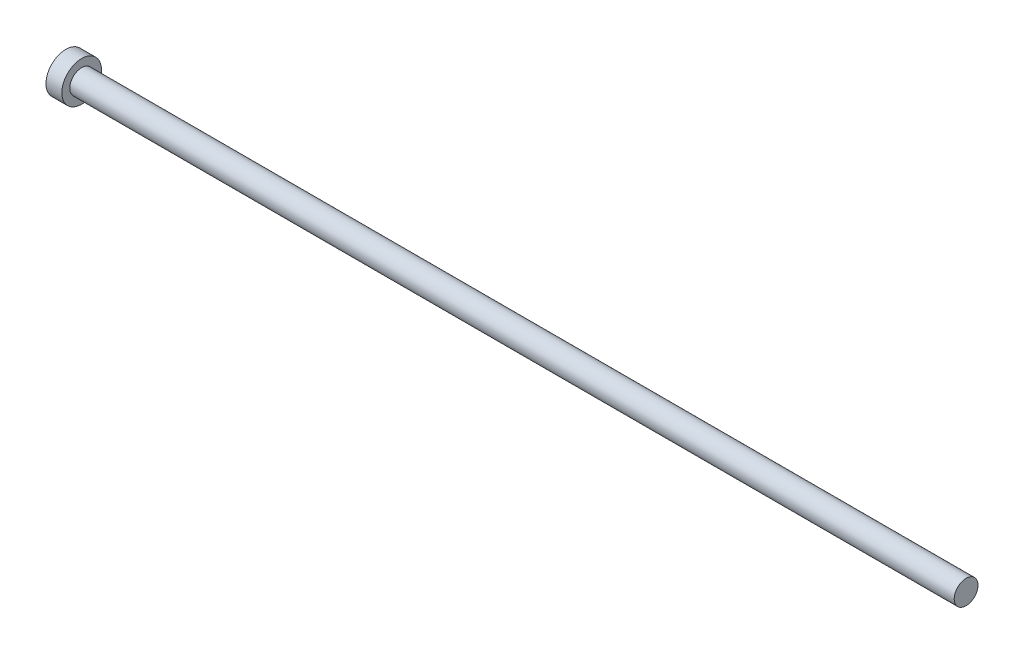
ISO-10303-21;
HEADER;
FILE_DESCRIPTION(('STEP AP214'),'2;1');
FILE_NAME('part.step','',(''),(''),'','','');
FILE_SCHEMA(('AUTOMOTIVE_DESIGN { 1 0 10303 214 1 1 1 1 }'));
ENDSEC;
DATA;
#1=APPLICATION_CONTEXT('core data for automotive mechanical design processes');
#2=APPLICATION_PROTOCOL_DEFINITION('international standard','automotive_design',2000,#1);
#3=PRODUCT_CONTEXT('',#1,'mechanical');
#4=PRODUCT('Part','Part','',(#3));
#5=PRODUCT_RELATED_PRODUCT_CATEGORY('part','',(#4));
#6=PRODUCT_DEFINITION_FORMATION('','',#4);
#7=PRODUCT_DEFINITION_CONTEXT('part definition',#1,'design');
#8=PRODUCT_DEFINITION('design','',#6,#7);
#9=PRODUCT_DEFINITION_SHAPE('','',#8);
#10=(LENGTH_UNIT() NAMED_UNIT(*) SI_UNIT(.MILLI.,.METRE.));
#11=(NAMED_UNIT(*) PLANE_ANGLE_UNIT() SI_UNIT($,.RADIAN.));
#12=(NAMED_UNIT(*) SI_UNIT($,.STERADIAN.) SOLID_ANGLE_UNIT());
#13=UNCERTAINTY_MEASURE_WITH_UNIT(LENGTH_MEASURE(1.E-05),#10,'distance_accuracy_value','');
#14=(GEOMETRIC_REPRESENTATION_CONTEXT(3) GLOBAL_UNCERTAINTY_ASSIGNED_CONTEXT((#13)) GLOBAL_UNIT_ASSIGNED_CONTEXT((#10,
#11,#12)) REPRESENTATION_CONTEXT('',''));
#15=CARTESIAN_POINT('',(0.,0.,0.));
#16=DIRECTION('',(0.,0.,1.));
#17=DIRECTION('',(1.,0.,0.));
#18=AXIS2_PLACEMENT_3D('',#15,#16,#17);
#19=CARTESIAN_POINT('',(0.,1.25,0.));
#20=DIRECTION('',(-1.,0.,0.));
#21=DIRECTION('',(0.,0.,1.));
#22=AXIS2_PLACEMENT_3D('',#19,#20,#21);
#23=PLANE('',#22);
#24=CARTESIAN_POINT('',(0.,0.,0.));
#25=DIRECTION('',(1.,0.,0.));
#26=DIRECTION('',(0.,0.,-1.));
#27=AXIS2_PLACEMENT_3D('',#24,#25,#26);
#28=CIRCLE('',#27,2.5);
#29=CARTESIAN_POINT('',(0.,0.,-2.5));
#30=VERTEX_POINT('',#29);
#31=EDGE_CURVE('E18',#30,#30,#28,.T.);
#32=ORIENTED_EDGE('',*,*,#31,.F.);
#33=EDGE_LOOP('',(#32));
#34=FACE_BOUND('',#33,.T.);
#35=ADVANCED_FACE('F15',(#34),#23,.T.);
#36=CARTESIAN_POINT('',(1.,0.,0.));
#37=DIRECTION('',(1.,0.,0.));
#38=DIRECTION('',(0.,0.,-1.));
#39=AXIS2_PLACEMENT_3D('',#36,#37,#38);
#40=CYLINDRICAL_SURFACE('',#39,2.5);
#41=ORIENTED_EDGE('',*,*,#31,.T.);
#42=EDGE_LOOP('',(#41));
#43=FACE_BOUND('',#42,.T.);
#44=CARTESIAN_POINT('',(2.,0.,0.));
#45=DIRECTION('',(1.,0.,0.));
#46=DIRECTION('',(0.,0.,-1.));
#47=AXIS2_PLACEMENT_3D('',#44,#45,#46);
#48=CIRCLE('',#47,2.5);
#49=CARTESIAN_POINT('',(2.,0.,-2.5));
#50=VERTEX_POINT('',#49);
#51=EDGE_CURVE('E27',#50,#50,#48,.T.);
#52=ORIENTED_EDGE('',*,*,#51,.F.);
#53=EDGE_LOOP('',(#52));
#54=FACE_BOUND('',#53,.T.);
#55=ADVANCED_FACE('F35',(#43,#54),#40,.T.);
#56=CARTESIAN_POINT('',(113.5,0.750000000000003,0.));
#57=DIRECTION('',(1.,0.,0.));
#58=DIRECTION('',(0.,0.,-1.));
#59=AXIS2_PLACEMENT_3D('',#56,#57,#58);
#60=PLANE('',#59);
#61=CARTESIAN_POINT('',(113.5,0.,0.));
#62=DIRECTION('',(1.,0.,0.));
#63=DIRECTION('',(0.,0.,-1.));
#64=AXIS2_PLACEMENT_3D('',#61,#62,#63);
#65=CIRCLE('',#64,1.5);
#66=CARTESIAN_POINT('',(113.5,0.,-1.5));
#67=VERTEX_POINT('',#66);
#68=EDGE_CURVE('E22',#67,#67,#65,.F.);
#69=ORIENTED_EDGE('',*,*,#68,.F.);
#70=EDGE_LOOP('',(#69));
#71=FACE_BOUND('',#70,.T.);
#72=ADVANCED_FACE('F43',(#71),#60,.T.);
#73=CARTESIAN_POINT('',(2.,2.,0.));
#74=DIRECTION('',(1.,0.,0.));
#75=DIRECTION('',(0.,0.,-1.));
#76=AXIS2_PLACEMENT_3D('',#73,#74,#75);
#77=PLANE('',#76);
#78=CARTESIAN_POINT('',(2.,0.,0.));
#79=DIRECTION('',(1.,0.,0.));
#80=DIRECTION('',(0.,0.,-1.));
#81=AXIS2_PLACEMENT_3D('',#78,#79,#80);
#82=CIRCLE('',#81,1.5);
#83=CARTESIAN_POINT('',(2.,0.,-1.5));
#84=VERTEX_POINT('',#83);
#85=EDGE_CURVE('E10',#84,#84,#82,.T.);
#86=ORIENTED_EDGE('',*,*,#85,.F.);
#87=EDGE_LOOP('',(#86));
#88=FACE_BOUND('',#87,.T.);
#89=ORIENTED_EDGE('',*,*,#51,.T.);
#90=EDGE_LOOP('',(#89));
#91=FACE_BOUND('',#90,.T.);
#92=ADVANCED_FACE('F46',(#88,#91),#77,.T.);
#93=CARTESIAN_POINT('',(57.75,0.,0.));
#94=DIRECTION('',(1.,0.,0.));
#95=DIRECTION('',(0.,0.,-1.));
#96=AXIS2_PLACEMENT_3D('',#93,#94,#95);
#97=CYLINDRICAL_SURFACE('',#96,1.5);
#98=ORIENTED_EDGE('',*,*,#85,.T.);
#99=EDGE_LOOP('',(#98));
#100=FACE_BOUND('',#99,.T.);
#101=ORIENTED_EDGE('',*,*,#68,.T.);
#102=EDGE_LOOP('',(#101));
#103=FACE_BOUND('',#102,.T.);
#104=ADVANCED_FACE('F44',(#100,#103),#97,.T.);
#105=CLOSED_SHELL('',(#35,#55,#72,#92,#104));
#106=MANIFOLD_SOLID_BREP('B1',#105);
#107=ADVANCED_BREP_SHAPE_REPRESENTATION('',(#18,#106),#14);
#108=SHAPE_DEFINITION_REPRESENTATION(#9,#107);
ENDSEC;
END-ISO-10303-21;
